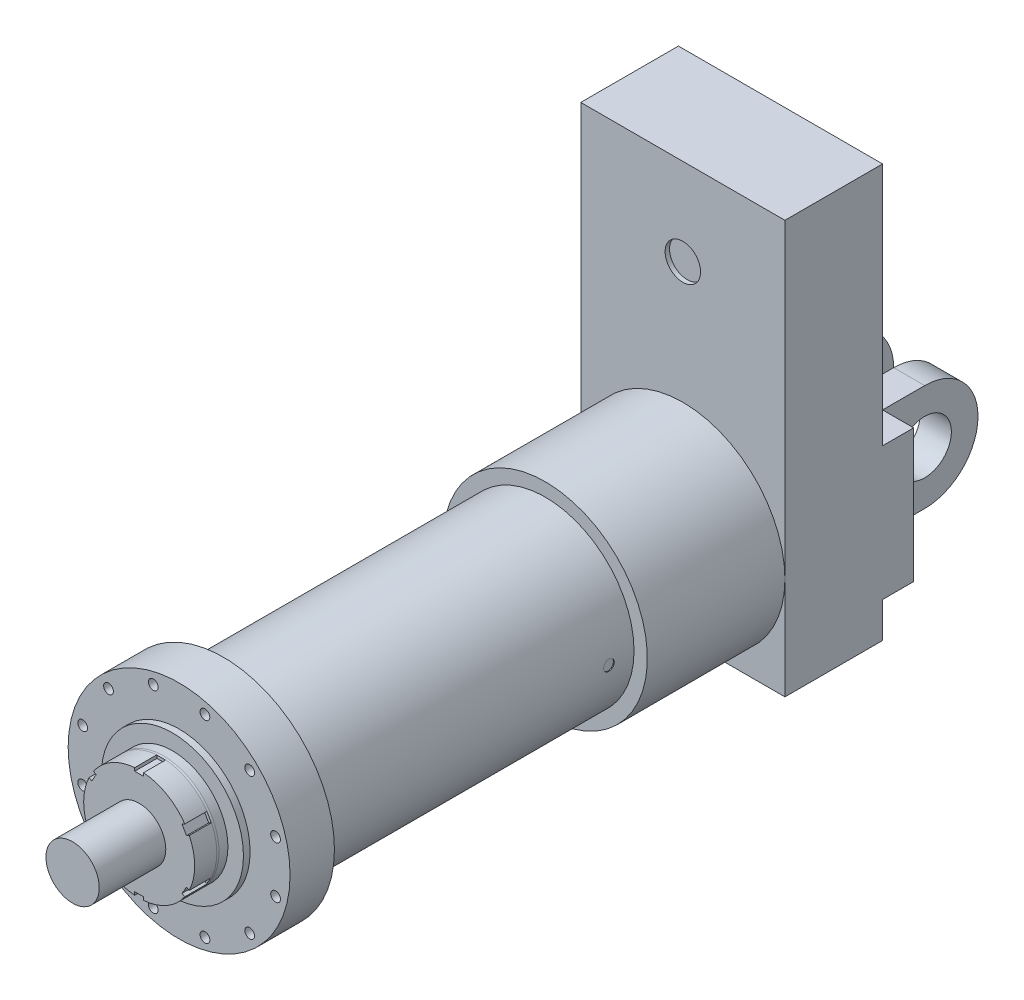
from build123d import *

# Parameters (mm, degrees)
SKETCH_1_R          = 200
EXTRUDE_1_DEPTH     = 725
SKETCH_2_R          = 250
SKETCH_2_R_2        = 11
EXTRUDE_2_DEPTH     = 100
SKETCH_3_R          = 160
EXTRUDE_3_DEPTH     = 15
SKETCH_4_R          = 125
EXTRUDE_4_DEPTH     = 25
CHAMFER_1_SIZE      = 5
CHAMFER_1_SIZE2     = 0.881634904
SKETCH_6_R          = 230
EXTRUDE_6_DEPTH     = 310
SKETCH_9_R          = 12
CUT_EXTRUDE_2_DEPTH = 2
SKETCH_10_R         = 12
CUT_EXTRUDE_3_DEPTH = 2
EXTRUDE_7_DEPTH     = 50
SKETCH_11_R         = 60
EXTRUDE_8_DEPTH     = 150
SKETCH_12_W         = 460
SKETCH_12_H         = 930
EXTRUDE_9_DEPTH     = 220
SKETCH_13_R         = 40
CUT_EXTRUDE_4_DEPTH = 10
SKETCH_14_W         = 460
SKETCH_14_H         = 300
EXTRUDE_10_DEPTH    = 70
SKETCH_15_W         = 70
SKETCH_15_H         = 240
EXTRUDE_11_DEPTH    = 245
SKETCH_16_R         = 60
CUT_EXTRUDE_5_DEPTH = 297
CHAMFER_2_SIZE      = 20


with BuildPart() as part:
    # Sketch 1 → Extrude 1 (new body)
    with BuildSketch(Plane.XY):
        Circle(SKETCH_1_R)
    extrude(amount=EXTRUDE_1_DEPTH)

    # Sketch 2 → Extrude 2 (add)
    with BuildSketch(Plane.XY.offset(725)):
        Circle(SKETCH_2_R)
        with Locations((217.333310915, 58.234285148)):
            Circle(SKETCH_2_R_2, mode=Mode.SUBTRACT)
        with Locations((217.333310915, -58.234285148)):
            Circle(SKETCH_2_R_2, mode=Mode.SUBTRACT)
        with Locations((159.099025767, -159.099025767)):
            Circle(SKETCH_2_R_2, mode=Mode.SUBTRACT)
        with Locations((58.234285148, -217.333310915)):
            Circle(SKETCH_2_R_2, mode=Mode.SUBTRACT)
        with Locations((-58.234285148, -217.333310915)):
            Circle(SKETCH_2_R_2, mode=Mode.SUBTRACT)
        with Locations((-159.099025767, -159.099025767)):
            Circle(SKETCH_2_R_2, mode=Mode.SUBTRACT)
        with Locations((-217.333310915, -58.234285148)):
            Circle(SKETCH_2_R_2, mode=Mode.SUBTRACT)
        with Locations((-217.333310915, 58.234285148)):
            Circle(SKETCH_2_R_2, mode=Mode.SUBTRACT)
        with Locations((-159.099025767, 159.099025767)):
            Circle(SKETCH_2_R_2, mode=Mode.SUBTRACT)
        with Locations((-58.234285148, 217.333310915)):
            Circle(SKETCH_2_R_2, mode=Mode.SUBTRACT)
        with Locations((58.234285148, 217.333310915)):
            Circle(SKETCH_2_R_2, mode=Mode.SUBTRACT)
        with Locations((159.099025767, 159.099025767)):
            Circle(SKETCH_2_R_2, mode=Mode.SUBTRACT)
    extrude(amount=EXTRUDE_2_DEPTH)

    # Sketch 3 → Extrude 3 (add)
    with BuildSketch(Plane.XY.offset(825)):
        Circle(SKETCH_3_R)
    extrude(amount=EXTRUDE_3_DEPTH)

    # Sketch 4 → Extrude 4 (add)
    with BuildSketch(Plane.XY.offset(840)):
        Circle(SKETCH_4_R)
    extrude(amount=EXTRUDE_4_DEPTH)

    # Chamfer 1
    chamfer_1_edges = [part.edges().sort_by_distance(p)[0] for p in [
        (-125, 0, 865),
    ]]
    chamfer_1_side = [part.faces().sort_by_distance(p)[0] for p in [
        (-125, 0, 852.5),
    ]]
    chamfer(chamfer_1_edges, length=CHAMFER_1_SIZE, length2=CHAMFER_1_SIZE2, reference=chamfer_1_side[0])

    # Sketch 6 → Extrude 6 (add)
    with BuildSketch(Plane(origin=(0, 0, 0), x_dir=(-1, 0, 0), z_dir=(0, 0, -1))):
        Circle(SKETCH_6_R)
    extrude(amount=EXTRUDE_6_DEPTH)

    # Sketch 9 → Cut-Extrude 2 (cut)
    with BuildSketch(Plane(origin=(-200, 0, 0), x_dir=(0, 0, -1), z_dir=(1, 0, 0))):
        with Locations(Location((-36.5, 0, 0), (0, 0, 180))):
            Circle(SKETCH_9_R)
        with Locations(Location((-670.5, 0, 0), (0, 0, 180))):
            Circle(SKETCH_9_R)
    extrude(amount=CUT_EXTRUDE_2_DEPTH, mode=Mode.SUBTRACT)

    # Sketch 10 → Cut-Extrude 3 (cut)
    with BuildSketch(Plane(origin=(200, 0, 0), x_dir=(0, 0, -1), z_dir=(1, 0, 0))):
        with Locations((-56.5, 0)):
            Circle(SKETCH_10_R)
    extrude(amount=-CUT_EXTRUDE_3_DEPTH, mode=Mode.SUBTRACT)

    # Sketch 5 → Extrude 7 (add)
    with BuildSketch(Plane.XY.offset(865)):
        with BuildLine():
            Line((-10, 124.599357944), (-10, 117.5))
            Line((-10, 117.5), (10, 117.5))
            Line((10, 117.5), (10, 124.599357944))
            ThreePointArc((10, 124.599357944), (62.5, 108.253175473), (102.906209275, 70.95993301))
            Line((102.906209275, 70.95993301), (96.757984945, 67.410254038))
            Line((96.757984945, 67.410254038), (106.757984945, 50.089745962))
            Line((106.757984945, 50.089745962), (112.906209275, 53.639424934))
            ThreePointArc((112.906209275, 53.639424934), (125, 0), (112.906209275, -53.639424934))
            Line((112.906209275, -53.639424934), (106.757984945, -50.089745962))
            Line((106.757984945, -50.089745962), (96.757984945, -67.410254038))
            Line((96.757984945, -67.410254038), (102.906209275, -70.95993301))
            ThreePointArc((102.906209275, -70.95993301), (62.5, -108.253175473), (10, -124.599357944))
            Line((10, -124.599357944), (10, -117.5))
            Line((10, -117.5), (-10, -117.5))
            Line((-10, -117.5), (-10, -124.599357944))
            ThreePointArc((-10, -124.599357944), (-62.5, -108.253175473), (-102.906209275, -70.95993301))
            Line((-102.906209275, -70.95993301), (-96.757984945, -67.410254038))
            Line((-96.757984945, -67.410254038), (-106.757984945, -50.089745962))
            Line((-106.757984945, -50.089745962), (-112.906209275, -53.639424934))
            ThreePointArc((-112.906209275, -53.639424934), (-125, 0), (-112.906209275, 53.639424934))
            Line((-112.906209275, 53.639424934), (-106.757984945, 50.089745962))
            Line((-106.757984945, 50.089745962), (-96.757984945, 67.410254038))
            Line((-96.757984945, 67.410254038), (-102.906209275, 70.95993301))
            ThreePointArc((-102.906209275, 70.95993301), (-62.5, 108.253175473), (-10, 124.599357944))
        make_face()
    extrude(amount=EXTRUDE_7_DEPTH)

    # Sketch 11 → Extrude 8 (add)
    with BuildSketch(Plane.XY.offset(915)):
        Circle(SKETCH_11_R)
    extrude(amount=EXTRUDE_8_DEPTH)

    # Sketch 12 → Extrude 9 (add)
    with BuildSketch(Plane(origin=(0, 0, -310), x_dir=(-1, 0, 0), z_dir=(0, 0, -1))):
        with Locations((0, 235)):
            Rectangle(SKETCH_12_W, SKETCH_12_H)
    extrude(amount=EXTRUDE_9_DEPTH)

    # Sketch 13 → Cut-Extrude 4 (cut)
    with BuildSketch(Plane.XY.offset(-310)):
        with Locations((0, 504)):
            Circle(SKETCH_13_R)
    extrude(amount=-CUT_EXTRUDE_4_DEPTH, mode=Mode.SUBTRACT)

    # Sketch 14 → Extrude 10 (add)
    with BuildSketch(Plane(origin=(0, 0, -530), x_dir=(-1, 0, 0), z_dir=(0, 0, -1))):
        Rectangle(SKETCH_14_W, SKETCH_14_H)
    extrude(amount=EXTRUDE_10_DEPTH)

    # Sketch 15 → Extrude 11 (add)
    with BuildSketch(Plane(origin=(0, 0, -600), x_dir=(-1, 0, 0), z_dir=(0, 0, -1))):
        with Locations((-95, 0)):
            Rectangle(SKETCH_15_W, SKETCH_15_H)
        with Locations((95, 0)):
            Rectangle(SKETCH_15_W, SKETCH_15_H)
    extrude(amount=EXTRUDE_11_DEPTH)

    # Sketch 16 → Cut-Extrude 5 (cut)
    with BuildSketch(Plane.ZY.offset(130)):
        with Locations(Location((-725, 0, 0), (0, 0, 270))):
            Circle(SKETCH_16_R)
        with BuildLine():
            Line((-725, 120), (-1030.485939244, 228.393341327))
            Line((-1030.485939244, 228.393341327), (-999.789731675, -216.236574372))
            Line((-999.789731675, -216.236574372), (-725, -120))
            ThreePointArc((-725, -120), (-845, 0), (-725, 120))
        make_face()
    extrude(amount=-CUT_EXTRUDE_5_DEPTH, mode=Mode.SUBTRACT)

    # Chamfer 2
    chamfer_2_edges = [part.edges().sort_by_distance(p)[0] for p in [
        (60, 0, -600),
        (95, 120, -600),
        (130, 0, -600),
        (95, -120, -600),
        (-130, 0, -600),
        (-95, 120, -600),
        (-60, 0, -600),
        (-95, -120, -600),
    ]]
    chamfer(chamfer_2_edges, length=CHAMFER_2_SIZE)


solid = part.part
